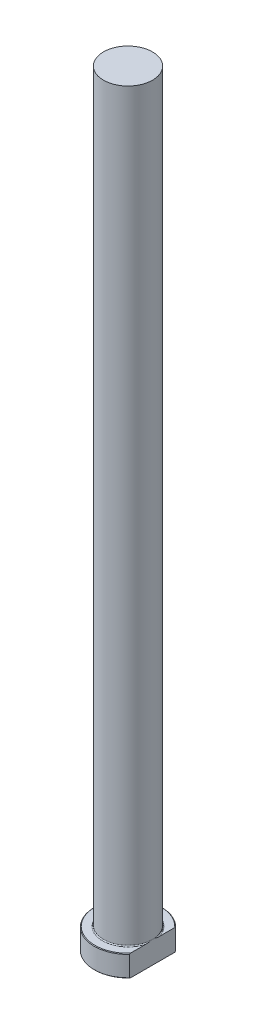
ISO-10303-21;
HEADER;
FILE_DESCRIPTION(('STEP AP214'),'2;1');
FILE_NAME('part.step','',(''),(''),'','','');
FILE_SCHEMA(('AUTOMOTIVE_DESIGN { 1 0 10303 214 1 1 1 1 }'));
ENDSEC;
DATA;
#1=APPLICATION_CONTEXT('core data for automotive mechanical design processes');
#2=APPLICATION_PROTOCOL_DEFINITION('international standard','automotive_design',2000,#1);
#3=PRODUCT_CONTEXT('',#1,'mechanical');
#4=PRODUCT('Part','Part','',(#3));
#5=PRODUCT_RELATED_PRODUCT_CATEGORY('part','',(#4));
#6=PRODUCT_DEFINITION_FORMATION('','',#4);
#7=PRODUCT_DEFINITION_CONTEXT('part definition',#1,'design');
#8=PRODUCT_DEFINITION('design','',#6,#7);
#9=PRODUCT_DEFINITION_SHAPE('','',#8);
#10=(LENGTH_UNIT() NAMED_UNIT(*) SI_UNIT(.MILLI.,.METRE.));
#11=(NAMED_UNIT(*) PLANE_ANGLE_UNIT() SI_UNIT($,.RADIAN.));
#12=(NAMED_UNIT(*) SI_UNIT($,.STERADIAN.) SOLID_ANGLE_UNIT());
#13=UNCERTAINTY_MEASURE_WITH_UNIT(LENGTH_MEASURE(1.E-05),#10,'distance_accuracy_value','');
#14=(GEOMETRIC_REPRESENTATION_CONTEXT(3) GLOBAL_UNCERTAINTY_ASSIGNED_CONTEXT((#13)) GLOBAL_UNIT_ASSIGNED_CONTEXT((#10,
#11,#12)) REPRESENTATION_CONTEXT('',''));
#15=CARTESIAN_POINT('',(0.,0.,0.));
#16=DIRECTION('',(0.,0.,1.));
#17=DIRECTION('',(1.,0.,0.));
#18=AXIS2_PLACEMENT_3D('',#15,#16,#17);
#19=CARTESIAN_POINT('',(0.,0.,0.));
#20=DIRECTION('',(0.,-1.,0.));
#21=DIRECTION('',(0.,0.,-1.));
#22=AXIS2_PLACEMENT_3D('',#19,#20,#21);
#23=PLANE('',#22);
#24=CARTESIAN_POINT('',(0.,0.,0.));
#25=DIRECTION('',(0.,-1.,0.));
#26=DIRECTION('',(0.,0.,-1.));
#27=AXIS2_PLACEMENT_3D('',#24,#25,#26);
#28=CIRCLE('',#27,10.7999999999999);
#29=CARTESIAN_POINT('',(7.99999999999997,0.,7.25534285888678));
#30=VERTEX_POINT('',#29);
#31=CARTESIAN_POINT('',(7.99999999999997,0.,-7.25534285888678));
#32=VERTEX_POINT('',#31);
#33=EDGE_CURVE('E98',#30,#32,#28,.T.);
#34=ORIENTED_EDGE('',*,*,#33,.T.);
#35=DIRECTION('',(0.,0.,1.));
#36=VECTOR('',#35,1.);
#37=CARTESIAN_POINT('',(7.99999999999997,0.,-7.54983443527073));
#38=LINE('',#37,#36);
#39=EDGE_CURVE('E83',#32,#30,#38,.T.);
#40=ORIENTED_EDGE('',*,*,#39,.T.);
#41=EDGE_LOOP('',(#34,#40));
#42=FACE_BOUND('',#41,.T.);
#43=ADVANCED_FACE('F32',(#42),#23,.T.);
#44=CARTESIAN_POINT('',(0.,259.958771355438,0.));
#45=DIRECTION('',(0.,1.,0.));
#46=DIRECTION('',(0.,0.,1.));
#47=AXIS2_PLACEMENT_3D('',#44,#45,#46);
#48=CYLINDRICAL_SURFACE('',#47,11.);
#49=CARTESIAN_POINT('',(0.,6.79999999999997,0.));
#50=DIRECTION('',(0.,1.,0.));
#51=DIRECTION('',(0.,0.,1.));
#52=AXIS2_PLACEMENT_3D('',#49,#50,#51);
#53=CIRCLE('',#52,11.);
#54=CARTESIAN_POINT('',(7.99999999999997,6.79999999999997,7.54983443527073));
#55=VERTEX_POINT('',#54);
#56=CARTESIAN_POINT('',(7.99999999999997,6.79999999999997,-7.54983443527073));
#57=VERTEX_POINT('',#56);
#58=EDGE_CURVE('E104',#55,#57,#53,.F.);
#59=ORIENTED_EDGE('',*,*,#58,.T.);
#60=DIRECTION('',(0.,-1.,0.));
#61=VECTOR('',#60,1.);
#62=CARTESIAN_POINT('',(7.99999999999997,250.,-7.54983443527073));
#63=LINE('',#62,#61);
#64=CARTESIAN_POINT('',(7.99999999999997,0.200000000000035,-7.54983443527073));
#65=VERTEX_POINT('',#64);
#66=EDGE_CURVE('E183',#57,#65,#63,.T.);
#67=ORIENTED_EDGE('',*,*,#66,.T.);
#68=CARTESIAN_POINT('',(0.,0.200000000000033,0.));
#69=DIRECTION('',(0.,-1.,0.));
#70=DIRECTION('',(0.,0.,-1.));
#71=AXIS2_PLACEMENT_3D('',#68,#69,#70);
#72=CIRCLE('',#71,11.);
#73=CARTESIAN_POINT('',(7.99999999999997,0.200000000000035,7.54983443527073));
#74=VERTEX_POINT('',#73);
#75=EDGE_CURVE('E100',#65,#74,#72,.F.);
#76=ORIENTED_EDGE('',*,*,#75,.T.);
#77=DIRECTION('',(0.,-1.,0.));
#78=VECTOR('',#77,1.);
#79=CARTESIAN_POINT('',(7.99999999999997,250.,7.54983443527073));
#80=LINE('',#79,#78);
#81=EDGE_CURVE('E93',#55,#74,#80,.T.);
#82=ORIENTED_EDGE('',*,*,#81,.F.);
#83=EDGE_LOOP('',(#59,#67,#76,#82));
#84=FACE_BOUND('',#83,.T.);
#85=ADVANCED_FACE('F158',(#84),#48,.T.);
#86=CARTESIAN_POINT('',(-11.,7.,0.));
#87=DIRECTION('',(0.,1.,0.));
#88=DIRECTION('',(0.,0.,1.));
#89=AXIS2_PLACEMENT_3D('',#86,#87,#88);
#90=PLANE('',#89);
#91=CARTESIAN_POINT('',(0.,7.,0.));
#92=DIRECTION('',(0.,1.,0.));
#93=DIRECTION('',(0.,0.,1.));
#94=AXIS2_PLACEMENT_3D('',#91,#92,#93);
#95=CIRCLE('',#94,10.8);
#96=CARTESIAN_POINT('',(7.99999999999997,7.,-7.25534285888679));
#97=VERTEX_POINT('',#96);
#98=CARTESIAN_POINT('',(7.99999999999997,7.,7.25534285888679));
#99=VERTEX_POINT('',#98);
#100=EDGE_CURVE('E178',#97,#99,#95,.T.);
#101=ORIENTED_EDGE('',*,*,#100,.T.);
#102=DIRECTION('',(0.,0.,-1.));
#103=VECTOR('',#102,1.);
#104=CARTESIAN_POINT('',(7.99999999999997,7.,0.));
#105=LINE('',#104,#103);
#106=CARTESIAN_POINT('',(7.99999999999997,6.99999999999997,2.21133443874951));
#107=VERTEX_POINT('',#106);
#108=EDGE_CURVE('E57',#99,#107,#105,.T.);
#109=ORIENTED_EDGE('',*,*,#108,.T.);
#110=CARTESIAN_POINT('',(0.,7.,0.));
#111=DIRECTION('',(0.,1.,0.));
#112=DIRECTION('',(0.,0.,1.));
#113=AXIS2_PLACEMENT_3D('',#110,#111,#112);
#114=CIRCLE('',#113,8.29999999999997);
#115=CARTESIAN_POINT('',(7.99999999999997,6.99999999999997,-2.21133443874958));
#116=VERTEX_POINT('',#115);
#117=EDGE_CURVE('E107',#107,#116,#114,.F.);
#118=ORIENTED_EDGE('',*,*,#117,.T.);
#119=EDGE_CURVE('E136',#116,#97,#105,.T.);
#120=ORIENTED_EDGE('',*,*,#119,.T.);
#121=EDGE_LOOP('',(#101,#109,#118,#120));
#122=FACE_BOUND('',#121,.T.);
#123=ADVANCED_FACE('F147',(#122),#90,.T.);
#124=CARTESIAN_POINT('',(0.,7.00000000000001,0.));
#125=DIRECTION('',(0.,-1.,0.));
#126=DIRECTION('',(0.,0.,-1.));
#127=AXIS2_PLACEMENT_3D('',#124,#125,#126);
#128=CONICAL_SURFACE('',#127,10.7999999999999,0.785398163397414);
#129=ORIENTED_EDGE('',*,*,#58,.F.);
#130=CARTESIAN_POINT('',(7.99999999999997,-0.636730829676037,16.6106304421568));
#131=CARTESIAN_POINT('',(7.99999999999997,-0.418611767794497,16.3685283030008));
#132=CARTESIAN_POINT('',(7.99999999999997,-0.200984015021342,16.1259843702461));
#133=CARTESIAN_POINT('',(7.99999999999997,0.233148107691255,15.6398927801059));
#134=CARTESIAN_POINT('',(7.99999999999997,0.449652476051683,15.3963451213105));
#135=CARTESIAN_POINT('',(7.99999999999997,1.09739989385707,14.6638687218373));
#136=CARTESIAN_POINT('',(7.99999999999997,1.52674426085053,14.1732538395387));
#137=CARTESIAN_POINT('',(7.99999999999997,2.16792810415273,13.4304656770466));
#138=CARTESIAN_POINT('',(7.99999999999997,2.38226067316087,13.180443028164));
#139=CARTESIAN_POINT('',(7.99999999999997,2.80892954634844,12.6787083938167));
#140=CARTESIAN_POINT('',(7.99999999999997,3.02126589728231,12.4269964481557));
#141=CARTESIAN_POINT('',(7.99999999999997,3.44357020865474,11.9216744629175));
#142=CARTESIAN_POINT('',(7.99999999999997,3.6535386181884,11.6680647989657));
#143=CARTESIAN_POINT('',(7.99999999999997,4.07074862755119,11.1585723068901));
#144=CARTESIAN_POINT('',(7.99999999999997,4.27798998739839,10.9026892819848));
#145=CARTESIAN_POINT('',(7.99999999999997,4.66965190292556,10.4127607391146));
#146=CARTESIAN_POINT('',(7.99999999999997,4.85436868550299,10.1789522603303));
#147=CARTESIAN_POINT('',(7.99999999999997,5.22063517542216,9.70886883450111));
#148=CARTESIAN_POINT('',(7.99999999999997,5.4021849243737,9.47259391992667));
#149=CARTESIAN_POINT('',(7.99999999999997,5.76149237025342,8.99721569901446));
#150=CARTESIAN_POINT('',(7.99999999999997,5.93925050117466,8.75811272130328));
#151=CARTESIAN_POINT('',(7.99999999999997,6.29022306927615,8.276601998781));
#152=CARTESIAN_POINT('',(7.99999999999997,6.46343768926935,8.03419438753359));
#153=CARTESIAN_POINT('',(7.99999999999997,6.80398487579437,7.54604999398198));
#154=CARTESIAN_POINT('',(7.99999999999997,6.97132935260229,7.3003215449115));
#155=CARTESIAN_POINT('',(7.99999999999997,7.29928849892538,6.80437777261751));
#156=CARTESIAN_POINT('',(7.99999999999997,7.45990280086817,6.55416220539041));
#157=CARTESIAN_POINT('',(7.99999999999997,7.77264940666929,6.04873149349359));
#158=CARTESIAN_POINT('',(7.99999999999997,7.92478824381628,5.79352041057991));
#159=CARTESIAN_POINT('',(7.99999999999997,8.21859570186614,5.27715744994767));
#160=CARTESIAN_POINT('',(7.99999999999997,8.36026610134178,5.01600659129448));
#161=CARTESIAN_POINT('',(7.99999999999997,8.62213596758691,4.50319242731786));
#162=CARTESIAN_POINT('',(7.99999999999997,8.74311989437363,4.25193242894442));
#163=CARTESIAN_POINT('',(7.99999999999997,8.97065709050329,3.74287674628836));
#164=CARTESIAN_POINT('',(7.99999999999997,9.07720941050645,3.48508063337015));
#165=CARTESIAN_POINT('',(7.99999999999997,9.27220860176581,2.96337495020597));
#166=CARTESIAN_POINT('',(7.99999999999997,9.36069936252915,2.69948197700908));
#167=CARTESIAN_POINT('',(7.99999999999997,9.51604316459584,2.16542713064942));
#168=CARTESIAN_POINT('',(7.99999999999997,9.58290677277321,1.89526838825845));
#169=CARTESIAN_POINT('',(7.99999999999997,9.68291221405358,1.39216000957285));
#170=CARTESIAN_POINT('',(7.99999999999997,9.71967474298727,1.15993430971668));
#171=CARTESIAN_POINT('',(7.99999999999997,9.77336730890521,0.69319665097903));
#172=CARTESIAN_POINT('',(7.99999999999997,9.7903003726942,0.458685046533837));
#173=CARTESIAN_POINT('',(7.99999999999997,9.8034285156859,-0.0106727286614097));
#174=CARTESIAN_POINT('',(7.99999999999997,9.79964609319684,-0.245518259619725));
#175=CARTESIAN_POINT('',(7.99999999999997,9.77160926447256,-0.713989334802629));
#176=CARTESIAN_POINT('',(7.99999999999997,9.74735189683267,-0.94761469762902));
#177=CARTESIAN_POINT('',(7.99999999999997,9.67070830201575,-1.47287443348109));
#178=CARTESIAN_POINT('',(7.99999999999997,9.61261890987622,-1.76367634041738));
#179=CARTESIAN_POINT('',(7.99999999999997,9.46982192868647,-2.33873282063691));
#180=CARTESIAN_POINT('',(7.99999999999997,9.38509750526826,-2.62298313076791));
#181=CARTESIAN_POINT('',(7.99999999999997,9.24134311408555,-3.04436856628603));
#182=CARTESIAN_POINT('',(7.99999999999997,9.19048552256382,-3.18437323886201));
#183=CARTESIAN_POINT('',(7.99999999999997,9.0838167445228,-3.4624156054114));
#184=CARTESIAN_POINT('',(7.99999999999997,9.0280078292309,-3.60045416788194));
#185=CARTESIAN_POINT('',(7.99999999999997,8.91195481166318,-3.87463242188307));
#186=CARTESIAN_POINT('',(7.99999999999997,8.85171106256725,-4.01077226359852));
#187=CARTESIAN_POINT('',(7.99999999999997,8.72725899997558,-4.28124317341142));
#188=CARTESIAN_POINT('',(7.99999999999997,8.66305017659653,-4.41557400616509));
#189=CARTESIAN_POINT('',(7.99999999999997,8.48984738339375,-4.76597692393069));
#190=CARTESIAN_POINT('',(7.99999999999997,8.37796178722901,-4.98062176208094));
#191=CARTESIAN_POINT('',(7.99999999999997,8.14649205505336,-5.40573762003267));
#192=CARTESIAN_POINT('',(7.99999999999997,8.02690659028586,-5.61620791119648));
#193=CARTESIAN_POINT('',(7.99999999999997,7.78128707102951,-6.03349586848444));
#194=CARTESIAN_POINT('',(7.99999999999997,7.65524949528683,-6.24031145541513));
#195=CARTESIAN_POINT('',(7.99999999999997,7.39783636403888,-6.65060320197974));
#196=CARTESIAN_POINT('',(7.99999999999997,7.26646042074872,-6.85407911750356));
#197=CARTESIAN_POINT('',(7.99999999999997,6.99890352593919,-7.25856399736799));
#198=CARTESIAN_POINT('',(7.99999999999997,6.86271149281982,-7.45956561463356));
#199=CARTESIAN_POINT('',(7.99999999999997,6.58651908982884,-7.85893907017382));
#200=CARTESIAN_POINT('',(7.99999999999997,6.4465185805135,-8.05731081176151));
#201=CARTESIAN_POINT('',(7.99999999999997,6.02178241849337,-8.6488124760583));
#202=CARTESIAN_POINT('',(7.99999999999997,5.73221467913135,-9.03847436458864));
#203=CARTESIAN_POINT('',(7.99999999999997,5.14234581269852,-9.8121850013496));
#204=CARTESIAN_POINT('',(7.99999999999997,4.84200393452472,-10.1962024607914));
#205=CARTESIAN_POINT('',(7.99999999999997,4.23404813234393,-10.9584616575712));
#206=CARTESIAN_POINT('',(7.99999999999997,3.92643376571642,-11.336703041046));
#207=CARTESIAN_POINT('',(7.99999999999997,3.30600745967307,-12.0880358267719));
#208=CARTESIAN_POINT('',(7.99999999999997,2.99320302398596,-12.4611334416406));
#209=CARTESIAN_POINT('',(7.99999999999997,2.36317801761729,-13.2035599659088));
#210=CARTESIAN_POINT('',(7.99999999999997,2.04595754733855,-13.5728889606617));
#211=CARTESIAN_POINT('',(7.99999999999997,1.33644011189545,-14.3909378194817));
#212=CARTESIAN_POINT('',(7.99999999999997,0.943258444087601,-14.8388897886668));
#213=CARTESIAN_POINT('',(7.99999999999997,0.35148359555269,-15.506812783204));
#214=CARTESIAN_POINT('',(7.99999999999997,0.154449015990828,-15.7281687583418));
#215=CARTESIAN_POINT('',(7.99999999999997,-0.240498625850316,-16.1700151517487));
#216=CARTESIAN_POINT('',(7.99999999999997,-0.438411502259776,-16.390505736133));
#217=CARTESIAN_POINT('',(7.99999999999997,-0.636730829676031,-16.6106304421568));
#218=B_SPLINE_CURVE_WITH_KNOTS('',3,(#130,#131,#132,#133,#134,#135,#136,#137,#138,#139,#140,
#141,#142,#143,#144,#145,#146,#147,#148,#149,#150,#151,#152,#153,#154,#155,#156,#157,#158,#159,
#160,#161,#162,#163,#164,#165,#166,#167,#168,#169,#170,#171,#172,#173,#174,#175,#176,#177,#178,
#179,#180,#181,#182,#183,#184,#185,#186,#187,#188,#189,#190,#191,#192,#193,#194,#195,#196,#197,
#198,#199,#200,#201,#202,#203,#204,#205,#206,#207,#208,#209,#210,#211,#212,#213,#214,#215,#216,
#217),.UNSPECIFIED.,.F.,.F.,(4,2,2,2,2,2,2,2,2,2,2,2,2,2,2,2,2,2,2,2,2,2,2,2,2,2,2,2,2,2,2,2,2,
2,2,2,2,2,2,2,2,2,2,4),(0.,0.977598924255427,1.95519922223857,3.91099512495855,4.89893858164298,
5.88685884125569,6.87458847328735,7.86240445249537,8.75629469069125,9.65017317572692,
10.5439487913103,11.4376883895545,12.3294952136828,13.2213506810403,14.1125088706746,
15.0035153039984,15.8397621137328,16.6760639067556,17.5103086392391,18.3441451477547,
19.0487229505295,19.7531931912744,20.4568984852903,21.1607055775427,22.0488428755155,
22.9375426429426,23.3843335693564,23.830920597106,24.2774720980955,24.72408114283,
25.4500411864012,26.1761268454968,26.902613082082,27.6291521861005,28.3574884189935,
29.0858513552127,30.5420520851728,32.0045059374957,33.4670490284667,34.9276355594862,
36.3881889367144,38.1762452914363,39.0652821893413,39.9541391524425),.UNSPECIFIED.);
#219=EDGE_CURVE('E135',#55,#99,#218,.T.);
#220=ORIENTED_EDGE('',*,*,#219,.T.);
#221=ORIENTED_EDGE('',*,*,#100,.F.);
#222=EDGE_CURVE('E127',#97,#57,#218,.T.);
#223=ORIENTED_EDGE('',*,*,#222,.T.);
#224=EDGE_LOOP('',(#129,#220,#221,#223));
#225=FACE_BOUND('',#224,.T.);
#226=ADVANCED_FACE('F143',(#225),#128,.T.);
#227=CARTESIAN_POINT('',(0.,0.200000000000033,0.));
#228=DIRECTION('',(0.,1.,0.));
#229=DIRECTION('',(0.,0.,1.));
#230=AXIS2_PLACEMENT_3D('',#227,#228,#229);
#231=CONICAL_SURFACE('',#230,11.,0.785398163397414);
#232=ORIENTED_EDGE('',*,*,#75,.F.);
#233=CARTESIAN_POINT('',(7.99999999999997,7.63673082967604,-16.6106304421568));
#234=CARTESIAN_POINT('',(7.99999999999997,7.4186117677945,-16.3685283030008));
#235=CARTESIAN_POINT('',(7.99999999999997,7.20098401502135,-16.1259843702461));
#236=CARTESIAN_POINT('',(7.99999999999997,6.76685189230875,-15.6398927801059));
#237=CARTESIAN_POINT('',(7.99999999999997,6.55034752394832,-15.3963451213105));
#238=CARTESIAN_POINT('',(7.99999999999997,5.90260010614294,-14.6638687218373));
#239=CARTESIAN_POINT('',(7.99999999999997,5.47325573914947,-14.1732538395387));
#240=CARTESIAN_POINT('',(7.99999999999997,4.83207189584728,-13.4304656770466));
#241=CARTESIAN_POINT('',(7.99999999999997,4.61773932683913,-13.180443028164));
#242=CARTESIAN_POINT('',(7.99999999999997,4.19107045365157,-12.6787083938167));
#243=CARTESIAN_POINT('',(7.99999999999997,3.9787341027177,-12.4269964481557));
#244=CARTESIAN_POINT('',(7.99999999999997,3.55642979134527,-11.9216744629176));
#245=CARTESIAN_POINT('',(7.99999999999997,3.34646138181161,-11.6680647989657));
#246=CARTESIAN_POINT('',(7.99999999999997,2.92925137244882,-11.1585723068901));
#247=CARTESIAN_POINT('',(7.99999999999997,2.72201001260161,-10.9026892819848));
#248=CARTESIAN_POINT('',(7.99999999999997,2.33034809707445,-10.4127607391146));
#249=CARTESIAN_POINT('',(7.99999999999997,2.14563131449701,-10.1789522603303));
#250=CARTESIAN_POINT('',(7.99999999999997,1.77936482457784,-9.70886883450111));
#251=CARTESIAN_POINT('',(7.99999999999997,1.59781507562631,-9.47259391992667));
#252=CARTESIAN_POINT('',(7.99999999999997,1.23850762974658,-8.99721569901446));
#253=CARTESIAN_POINT('',(7.99999999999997,1.06074949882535,-8.75811272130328));
#254=CARTESIAN_POINT('',(7.99999999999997,0.709776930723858,-8.276601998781));
#255=CARTESIAN_POINT('',(7.99999999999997,0.536562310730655,-8.03419438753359));
#256=CARTESIAN_POINT('',(7.99999999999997,0.196015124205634,-7.54604999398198));
#257=CARTESIAN_POINT('',(7.99999999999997,0.0286706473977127,-7.3003215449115));
#258=CARTESIAN_POINT('',(7.99999999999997,-0.299288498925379,-6.80437777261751));
#259=CARTESIAN_POINT('',(7.99999999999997,-0.459902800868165,-6.55416220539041));
#260=CARTESIAN_POINT('',(7.99999999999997,-0.772649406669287,-6.04873149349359));
#261=CARTESIAN_POINT('',(7.99999999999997,-0.924788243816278,-5.7935204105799));
#262=CARTESIAN_POINT('',(7.99999999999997,-1.21859570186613,-5.27715744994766));
#263=CARTESIAN_POINT('',(7.99999999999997,-1.36026610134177,-5.01600659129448));
#264=CARTESIAN_POINT('',(7.99999999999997,-1.62213596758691,-4.50319242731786));
#265=CARTESIAN_POINT('',(7.99999999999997,-1.74311989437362,-4.25193242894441));
#266=CARTESIAN_POINT('',(7.99999999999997,-1.97065709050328,-3.74287674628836));
#267=CARTESIAN_POINT('',(7.99999999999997,-2.07720941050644,-3.48508063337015));
#268=CARTESIAN_POINT('',(7.99999999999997,-2.27220860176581,-2.96337495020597));
#269=CARTESIAN_POINT('',(7.99999999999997,-2.36069936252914,-2.69948197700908));
#270=CARTESIAN_POINT('',(7.99999999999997,-2.51604316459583,-2.16542713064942));
#271=CARTESIAN_POINT('',(7.99999999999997,-2.58290677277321,-1.89526838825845));
#272=CARTESIAN_POINT('',(7.99999999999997,-2.68291221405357,-1.39216000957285));
#273=CARTESIAN_POINT('',(7.99999999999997,-2.71967474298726,-1.15993430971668));
#274=CARTESIAN_POINT('',(7.99999999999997,-2.77336730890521,-0.693196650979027));
#275=CARTESIAN_POINT('',(7.99999999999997,-2.7903003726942,-0.458685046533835));
#276=CARTESIAN_POINT('',(7.99999999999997,-2.80342851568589,0.0106727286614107));
#277=CARTESIAN_POINT('',(7.99999999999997,-2.79964609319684,0.245518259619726));
#278=CARTESIAN_POINT('',(7.99999999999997,-2.77160926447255,0.71398933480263));
#279=CARTESIAN_POINT('',(7.99999999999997,-2.74735189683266,0.94761469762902));
#280=CARTESIAN_POINT('',(7.99999999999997,-2.67070830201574,1.47287443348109));
#281=CARTESIAN_POINT('',(7.99999999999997,-2.61261890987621,1.76367634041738));
#282=CARTESIAN_POINT('',(7.99999999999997,-2.46982192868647,2.33873282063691));
#283=CARTESIAN_POINT('',(7.99999999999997,-2.38509750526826,2.62298313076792));
#284=CARTESIAN_POINT('',(7.99999999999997,-2.24134311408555,3.04436856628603));
#285=CARTESIAN_POINT('',(7.99999999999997,-2.19048552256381,3.184373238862));
#286=CARTESIAN_POINT('',(7.99999999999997,-2.08381674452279,3.46241560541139));
#287=CARTESIAN_POINT('',(7.99999999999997,-2.02800782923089,3.60045416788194));
#288=CARTESIAN_POINT('',(7.99999999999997,-1.91195481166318,3.87463242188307));
#289=CARTESIAN_POINT('',(7.99999999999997,-1.85171106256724,4.01077226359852));
#290=CARTESIAN_POINT('',(7.99999999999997,-1.72725899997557,4.28124317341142));
#291=CARTESIAN_POINT('',(7.99999999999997,-1.66305017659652,4.4155740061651));
#292=CARTESIAN_POINT('',(7.99999999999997,-1.48984738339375,4.76597692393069));
#293=CARTESIAN_POINT('',(7.99999999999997,-1.377961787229,4.98062176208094));
#294=CARTESIAN_POINT('',(7.99999999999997,-1.14649205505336,5.40573762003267));
#295=CARTESIAN_POINT('',(7.99999999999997,-1.02690659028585,5.61620791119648));
#296=CARTESIAN_POINT('',(7.99999999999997,-0.781287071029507,6.03349586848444));
#297=CARTESIAN_POINT('',(7.99999999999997,-0.655249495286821,6.24031145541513));
#298=CARTESIAN_POINT('',(7.99999999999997,-0.397836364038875,6.65060320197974));
#299=CARTESIAN_POINT('',(7.99999999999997,-0.266460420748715,6.85407911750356));
#300=CARTESIAN_POINT('',(7.99999999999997,0.00109647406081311,7.25856399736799));
#301=CARTESIAN_POINT('',(7.99999999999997,0.137288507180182,7.45956561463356));
#302=CARTESIAN_POINT('',(7.99999999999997,0.413480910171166,7.85893907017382));
#303=CARTESIAN_POINT('',(7.99999999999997,0.553481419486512,8.05731081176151));
#304=CARTESIAN_POINT('',(7.99999999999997,0.978217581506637,8.6488124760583));
#305=CARTESIAN_POINT('',(7.99999999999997,1.26778532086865,9.03847436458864));
#306=CARTESIAN_POINT('',(7.99999999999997,1.85765418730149,9.8121850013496));
#307=CARTESIAN_POINT('',(7.99999999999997,2.15799606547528,10.1962024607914));
#308=CARTESIAN_POINT('',(7.99999999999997,2.76595186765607,10.9584616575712));
#309=CARTESIAN_POINT('',(7.99999999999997,3.07356623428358,11.3367030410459));
#310=CARTESIAN_POINT('',(7.99999999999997,3.69399254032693,12.0880358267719));
#311=CARTESIAN_POINT('',(7.99999999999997,4.00679697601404,12.4611334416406));
#312=CARTESIAN_POINT('',(7.99999999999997,4.63682198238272,13.2035599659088));
#313=CARTESIAN_POINT('',(7.99999999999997,4.95404245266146,13.5728889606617));
#314=CARTESIAN_POINT('',(7.99999999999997,5.66355988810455,14.3909378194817));
#315=CARTESIAN_POINT('',(7.99999999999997,6.0567415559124,14.8388897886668));
#316=CARTESIAN_POINT('',(7.99999999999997,6.64851640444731,15.506812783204));
#317=CARTESIAN_POINT('',(7.99999999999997,6.84555098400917,15.7281687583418));
#318=CARTESIAN_POINT('',(7.99999999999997,7.24049862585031,16.1700151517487));
#319=CARTESIAN_POINT('',(7.99999999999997,7.43841150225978,16.390505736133));
#320=CARTESIAN_POINT('',(7.99999999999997,7.63673082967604,16.6106304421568));
#321=B_SPLINE_CURVE_WITH_KNOTS('',3,(#233,#234,#235,#236,#237,#238,#239,#240,#241,#242,#243,
#244,#245,#246,#247,#248,#249,#250,#251,#252,#253,#254,#255,#256,#257,#258,#259,#260,#261,#262,
#263,#264,#265,#266,#267,#268,#269,#270,#271,#272,#273,#274,#275,#276,#277,#278,#279,#280,#281,
#282,#283,#284,#285,#286,#287,#288,#289,#290,#291,#292,#293,#294,#295,#296,#297,#298,#299,#300,
#301,#302,#303,#304,#305,#306,#307,#308,#309,#310,#311,#312,#313,#314,#315,#316,#317,#318,#319,
#320),.UNSPECIFIED.,.F.,.F.,(4,2,2,2,2,2,2,2,2,2,2,2,2,2,2,2,2,2,2,2,2,2,2,2,2,2,2,2,2,2,2,2,2,
2,2,2,2,2,2,2,2,2,2,4),(0.,0.977598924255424,1.95519922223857,3.91099512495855,4.89893858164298,
5.88685884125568,6.87458847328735,7.86240445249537,8.75629469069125,9.65017317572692,
10.5439487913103,11.4376883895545,12.3294952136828,13.2213506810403,14.1125088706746,
15.0035153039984,15.8397621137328,16.6760639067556,17.5103086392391,18.3441451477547,
19.0487229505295,19.7531931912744,20.4568984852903,21.1607055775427,22.0488428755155,
22.9375426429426,23.3843335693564,23.830920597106,24.2774720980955,24.72408114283,
25.4500411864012,26.1761268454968,26.902613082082,27.6291521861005,28.3574884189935,
29.0858513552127,30.5420520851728,32.0045059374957,33.4670490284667,34.9276355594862,
36.3881889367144,38.1762452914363,39.0652821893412,39.9541391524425),.UNSPECIFIED.);
#322=EDGE_CURVE('E86',#65,#32,#321,.T.);
#323=ORIENTED_EDGE('',*,*,#322,.T.);
#324=ORIENTED_EDGE('',*,*,#33,.F.);
#325=EDGE_CURVE('E89',#30,#74,#321,.T.);
#326=ORIENTED_EDGE('',*,*,#325,.T.);
#327=EDGE_LOOP('',(#232,#323,#324,#326));
#328=FACE_BOUND('',#327,.T.);
#329=ADVANCED_FACE('F97',(#328),#231,.T.);
#330=CARTESIAN_POINT('',(0.,7.29999999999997,0.));
#331=DIRECTION('',(0.,1.,0.));
#332=DIRECTION('',(0.,0.,1.));
#333=AXIS2_PLACEMENT_3D('',#330,#331,#332);
#334=TOROIDAL_SURFACE('',#333,8.29999999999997,0.3);
#335=CARTESIAN_POINT('',(7.99999999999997,7.29999999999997,0.));
#336=CARTESIAN_POINT('',(7.99999999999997,7.30000062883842,1.41343368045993E-10));
#337=CARTESIAN_POINT('',(7.99999999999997,7.30000125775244,-3.45355322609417E-07));
#338=CARTESIAN_POINT('',(7.99999999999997,7.30000241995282,-1.23398463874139E-06));
#339=CARTESIAN_POINT('',(7.99999999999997,7.30000291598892,-1.80141989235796E-06));
#340=CARTESIAN_POINT('',(7.99999999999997,7.30000399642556,-3.18390842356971E-06));
#341=CARTESIAN_POINT('',(7.99999999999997,7.30000456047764,-4.02115832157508E-06));
#342=CARTESIAN_POINT('',(7.99999999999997,7.30000552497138,-5.71072460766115E-06));
#343=CARTESIAN_POINT('',(7.99999999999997,7.30000593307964,-6.55926444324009E-06));
#344=CARTESIAN_POINT('',(7.99999999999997,7.30000755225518,-1.000964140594E-05));
#345=CARTESIAN_POINT('',(7.99999999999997,7.30000869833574,-1.26477244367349E-05));
#346=CARTESIAN_POINT('',(7.99999999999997,7.30001047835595,-1.77422280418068E-05));
#347=CARTESIAN_POINT('',(7.99999999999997,7.30001115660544,-2.01836505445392E-05));
#348=CARTESIAN_POINT('',(7.99999999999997,7.30001417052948,-3.09435594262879E-05));
#349=CARTESIAN_POINT('',(7.99999999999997,7.30001656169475,-3.92473415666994E-05));
#350=CARTESIAN_POINT('',(7.99999999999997,7.30001991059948,-5.46311733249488E-05));
#351=CARTESIAN_POINT('',(7.99999999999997,7.30002104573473,-6.16717033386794E-05));
#352=CARTESIAN_POINT('',(7.99999999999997,7.30002955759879,-0.000115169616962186));
#353=CARTESIAN_POINT('',(7.99999999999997,7.30003630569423,-0.000161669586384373));
#354=CARTESIAN_POINT('',(7.99999999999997,7.30006581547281,-0.00034712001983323));
#355=CARTESIAN_POINT('',(7.99999999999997,7.30009364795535,-0.000485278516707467));
#356=CARTESIAN_POINT('',(7.99999999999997,7.30020325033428,-0.00103711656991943));
#357=CARTESIAN_POINT('',(7.99999999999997,7.30028197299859,-0.00145117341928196));
#358=CARTESIAN_POINT('',(7.99999999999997,7.30059973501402,-0.00311182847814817));
#359=CARTESIAN_POINT('',(7.99999999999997,7.30084275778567,-0.00435790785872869));
#360=CARTESIAN_POINT('',(7.99999999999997,7.30186073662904,-0.00958966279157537));
#361=CARTESIAN_POINT('',(7.99999999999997,7.30263061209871,-0.0135760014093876));
#362=CARTESIAN_POINT('',(7.99999999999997,7.30870312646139,-0.0450030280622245));
#363=CARTESIAN_POINT('',(7.99999999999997,7.31402334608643,-0.0724414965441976));
#364=CARTESIAN_POINT('',(7.99999999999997,7.32442239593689,-0.126197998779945));
#365=CARTESIAN_POINT('',(7.99999999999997,7.32950218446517,-0.152515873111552));
#366=CARTESIAN_POINT('',(7.99999999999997,7.34609783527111,-0.23868034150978));
#367=CARTESIAN_POINT('',(7.99999999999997,7.35757011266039,-0.29853557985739));
#368=CARTESIAN_POINT('',(7.99999999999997,7.37688511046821,-0.400403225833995));
#369=CARTESIAN_POINT('',(7.99999999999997,7.38478827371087,-0.442404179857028));
#370=CARTESIAN_POINT('',(7.99999999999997,7.40022249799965,-0.525284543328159));
#371=CARTESIAN_POINT('',(7.99999999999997,7.40775782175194,-0.566163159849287));
#372=CARTESIAN_POINT('',(7.99999999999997,7.4322438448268,-0.700743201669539));
#373=CARTESIAN_POINT('',(7.99999999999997,7.44879297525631,-0.794518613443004));
#374=CARTESIAN_POINT('',(7.99999999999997,7.48053424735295,-0.983225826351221));
#375=CARTESIAN_POINT('',(7.99999999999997,7.49571186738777,-1.07816009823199));
#376=CARTESIAN_POINT('',(7.99999999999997,7.52532008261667,-1.27781321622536));
#377=CARTESIAN_POINT('',(7.99999999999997,7.53952614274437,-1.38256589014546));
#378=CARTESIAN_POINT('',(7.99999999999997,7.564310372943,-1.59223320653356));
#379=CARTESIAN_POINT('',(7.99999999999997,7.57489817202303,-1.6971466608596));
#380=CARTESIAN_POINT('',(7.99999999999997,7.58780012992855,-1.86417161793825));
#381=CARTESIAN_POINT('',(7.99999999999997,7.59172630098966,-1.92615747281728));
#382=CARTESIAN_POINT('',(7.99999999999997,7.59748111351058,-2.05022364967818));
#383=CARTESIAN_POINT('',(7.99999999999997,7.59931001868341,-2.11230395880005));
#384=CARTESIAN_POINT('',(7.99999999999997,7.60036180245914,-2.23528941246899));
#385=CARTESIAN_POINT('',(7.99999999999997,7.59963462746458,-2.29619395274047));
#386=CARTESIAN_POINT('',(7.99999999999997,7.59500883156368,-2.41785147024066));
#387=CARTESIAN_POINT('',(7.99999999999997,7.59111224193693,-2.47860451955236));
#388=CARTESIAN_POINT('',(7.99999999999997,7.57906933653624,-2.60042626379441));
#389=CARTESIAN_POINT('',(7.99999999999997,7.570876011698,-2.66149089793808));
#390=CARTESIAN_POINT('',(7.99999999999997,7.55390997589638,-2.7523359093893));
#391=CARTESIAN_POINT('',(7.99999999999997,7.54745990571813,-2.78254437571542));
#392=CARTESIAN_POINT('',(7.99999999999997,7.5325641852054,-2.84244543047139));
#393=CARTESIAN_POINT('',(7.99999999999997,7.52412026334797,-2.87213844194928));
#394=CARTESIAN_POINT('',(7.99999999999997,7.50454333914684,-2.93081083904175));
#395=CARTESIAN_POINT('',(7.99999999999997,7.4933995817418,-2.95978684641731));
#396=CARTESIAN_POINT('',(7.99999999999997,7.47379430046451,-3.00191342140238));
#397=CARTESIAN_POINT('',(7.99999999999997,7.46677809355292,-3.01573193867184));
#398=CARTESIAN_POINT('',(7.99999999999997,7.45153430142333,-3.04267574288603));
#399=CARTESIAN_POINT('',(7.99999999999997,7.44330842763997,-3.05580197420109));
#400=CARTESIAN_POINT('',(7.99999999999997,7.42520334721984,-3.0811225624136));
#401=CARTESIAN_POINT('',(7.99999999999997,7.41530529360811,-3.09330368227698));
#402=CARTESIAN_POINT('',(7.99999999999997,7.39348961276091,-3.11567039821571));
#403=CARTESIAN_POINT('',(7.99999999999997,7.38158911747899,-3.12587146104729));
#404=CARTESIAN_POINT('',(7.99999999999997,7.3626809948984,-3.13802739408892));
#405=CARTESIAN_POINT('',(7.99999999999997,7.35660667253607,-3.14142291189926));
#406=CARTESIAN_POINT('',(7.99999999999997,7.34401523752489,-3.14727797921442));
#407=CARTESIAN_POINT('',(7.99999999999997,7.33749832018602,-3.14973793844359));
#408=CARTESIAN_POINT('',(7.99999999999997,7.32406766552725,-3.15352036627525));
#409=CARTESIAN_POINT('',(7.99999999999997,7.31715078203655,-3.15483196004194));
#410=CARTESIAN_POINT('',(7.99999999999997,7.30319454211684,-3.15612126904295));
#411=CARTESIAN_POINT('',(7.99999999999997,7.29615528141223,-3.15609998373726));
#412=CARTESIAN_POINT('',(7.99999999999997,7.28287791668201,-3.15479583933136));
#413=CARTESIAN_POINT('',(7.99999999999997,7.27662738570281,-3.15363338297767));
#414=CARTESIAN_POINT('',(7.99999999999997,7.26438977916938,-3.15033645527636));
#415=CARTESIAN_POINT('',(7.99999999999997,7.25840290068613,-3.14820126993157));
#416=CARTESIAN_POINT('',(7.99999999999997,7.24428488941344,-3.14202752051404));
#417=CARTESIAN_POINT('',(7.99999999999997,7.2363403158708,-3.13756526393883));
#418=CARTESIAN_POINT('',(7.99999999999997,7.22124755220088,-3.1274544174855));
#419=CARTESIAN_POINT('',(7.99999999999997,7.21410153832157,-3.12180270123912));
#420=CARTESIAN_POINT('',(7.99999999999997,7.19559955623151,-3.10524942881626));
#421=CARTESIAN_POINT('',(7.99999999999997,7.18498382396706,-3.09352989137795));
#422=CARTESIAN_POINT('',(7.99999999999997,7.16550497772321,-3.068745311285));
#423=CARTESIAN_POINT('',(7.99999999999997,7.15664572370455,-3.05567739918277));
#424=CARTESIAN_POINT('',(7.99999999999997,7.13735489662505,-3.02391619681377));
#425=CARTESIAN_POINT('',(7.99999999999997,7.12749252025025,-3.00488123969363));
#426=CARTESIAN_POINT('',(7.99999999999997,7.10958189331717,-2.96596235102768));
#427=CARTESIAN_POINT('',(7.99999999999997,7.10153733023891,-2.9460767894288));
#428=CARTESIAN_POINT('',(7.99999999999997,7.08679055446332,-2.90559744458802));
#429=CARTESIAN_POINT('',(7.99999999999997,7.08010240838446,-2.88499860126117));
#430=CARTESIAN_POINT('',(7.99999999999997,7.06789000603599,-2.84348873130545));
#431=CARTESIAN_POINT('',(7.99999999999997,7.06236453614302,-2.8225780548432));
#432=CARTESIAN_POINT('',(7.99999999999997,7.04913807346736,-2.76752236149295));
#433=CARTESIAN_POINT('',(7.99999999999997,7.04220598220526,-2.73319311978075));
#434=CARTESIAN_POINT('',(7.99999999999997,7.0302605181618,-2.66419726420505));
#435=CARTESIAN_POINT('',(7.99999999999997,7.02524820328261,-2.62953047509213));
#436=CARTESIAN_POINT('',(7.99999999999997,7.0124950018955,-2.52504816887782));
#437=CARTESIAN_POINT('',(7.99999999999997,7.00708017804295,-2.45494936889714));
#438=CARTESIAN_POINT('',(7.99999999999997,7.000733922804,-2.31725135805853));
#439=CARTESIAN_POINT('',(7.99999999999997,6.99964073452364,-2.24965783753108));
#440=CARTESIAN_POINT('',(7.99999999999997,7.00055672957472,-2.11488194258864));
#441=CARTESIAN_POINT('',(7.99999999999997,7.00254831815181,-2.04769941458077));
#442=CARTESIAN_POINT('',(7.99999999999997,7.00911662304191,-1.91019632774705));
#443=CARTESIAN_POINT('',(7.99999999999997,7.01381425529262,-1.83988191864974));
#444=CARTESIAN_POINT('',(7.99999999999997,7.02534418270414,-1.69947139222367));
#445=CARTESIAN_POINT('',(7.99999999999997,7.0321753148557,-1.62937517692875));
#446=CARTESIAN_POINT('',(7.99999999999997,7.04774659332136,-1.48770318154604));
#447=CARTESIAN_POINT('',(7.99999999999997,7.05652844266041,-1.41613205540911));
#448=CARTESIAN_POINT('',(7.99999999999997,7.0755719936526,-1.2729917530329));
#449=CARTESIAN_POINT('',(7.99999999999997,7.08583764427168,-1.20142310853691));
#450=CARTESIAN_POINT('',(7.99999999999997,7.11167035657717,-1.03117663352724));
#451=CARTESIAN_POINT('',(7.99999999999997,7.12776522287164,-0.932579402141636));
#452=CARTESIAN_POINT('',(7.99999999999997,7.16130143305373,-0.736797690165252));
#453=CARTESIAN_POINT('',(7.99999999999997,7.1787249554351,-0.639610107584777));
#454=CARTESIAN_POINT('',(7.99999999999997,7.21241690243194,-0.456833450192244));
#455=CARTESIAN_POINT('',(7.99999999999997,7.22858010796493,-0.37122483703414));
#456=CARTESIAN_POINT('',(7.99999999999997,7.25353789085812,-0.240583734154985));
#457=CARTESIAN_POINT('',(7.99999999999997,7.26219901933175,-0.195525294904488));
#458=CARTESIAN_POINT('',(7.99999999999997,7.27945035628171,-0.106166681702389));
#459=CARTESIAN_POINT('',(7.99999999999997,7.28803936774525,-0.0618662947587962));
#460=CARTESIAN_POINT('',(7.99999999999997,7.29737150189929,-0.0135646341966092));
#461=CARTESIAN_POINT('',(7.99999999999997,7.29814363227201,-0.0095669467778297));
#462=CARTESIAN_POINT('',(7.99999999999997,7.29916212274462,-0.0043326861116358));
#463=CARTESIAN_POINT('',(7.99999999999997,7.29940341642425,-0.003095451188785));
#464=CARTESIAN_POINT('',(7.99999999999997,7.29971907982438,-0.00144576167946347));
#465=CARTESIAN_POINT('',(7.99999999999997,7.29979739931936,-0.00103382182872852));
#466=CARTESIAN_POINT('',(7.99999999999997,7.29990652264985,-0.000484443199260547));
#467=CARTESIAN_POINT('',(7.99999999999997,7.29993429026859,-0.000346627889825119));
#468=CARTESIAN_POINT('',(7.99999999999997,7.2999637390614,-0.000161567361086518));
#469=CARTESIAN_POINT('',(7.99999999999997,7.29997047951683,-0.000115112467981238));
#470=CARTESIAN_POINT('',(7.99999999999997,7.29997897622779,-6.16610384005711E-05));
#471=CARTESIAN_POINT('',(7.99999999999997,7.29998010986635,-5.46227082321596E-05));
#472=CARTESIAN_POINT('',(7.99999999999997,7.299983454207,-3.92436766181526E-05));
#473=CARTESIAN_POINT('',(7.99999999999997,7.2999858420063,-3.09423877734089E-05));
#474=CARTESIAN_POINT('',(7.99999999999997,7.29998885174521,-2.01851368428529E-05));
#475=CARTESIAN_POINT('',(7.99999999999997,7.29998952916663,-1.7743877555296E-05));
#476=CARTESIAN_POINT('',(7.99999999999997,7.29999130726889,-1.26495938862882E-05));
#477=CARTESIAN_POINT('',(7.99999999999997,7.29999245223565,-1.00115437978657E-05));
#478=CARTESIAN_POINT('',(7.99999999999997,7.29999406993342,-6.56108535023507E-06));
#479=CARTESIAN_POINT('',(7.99999999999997,7.29999447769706,-5.71247448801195E-06));
#480=CARTESIAN_POINT('',(7.99999999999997,7.29999544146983,-4.02270412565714E-06));
#481=CARTESIAN_POINT('',(7.99999999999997,7.2999960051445,-3.18531707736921E-06));
#482=CARTESIAN_POINT('',(7.99999999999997,7.29999708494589,-1.80252014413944E-06));
#483=CARTESIAN_POINT('',(7.99999999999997,7.29999758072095,-1.23492752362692E-06));
#484=CARTESIAN_POINT('',(7.99999999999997,7.29999874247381,-3.45879353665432E-07));
#485=CARTESIAN_POINT('',(7.99999999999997,7.29999937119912,-1.41334918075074E-10));
#486=CARTESIAN_POINT('',(7.99999999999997,7.29999999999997,0.));
#487=B_SPLINE_CURVE_WITH_KNOTS('',3,(#335,#336,#337,#338,#339,#340,#341,#342,#343,#344,#345,
#346,#347,#348,#349,#350,#351,#352,#353,#354,#355,#356,#357,#358,#359,#360,#361,#362,#363,#364,
#365,#366,#367,#368,#369,#370,#371,#372,#373,#374,#375,#376,#377,#378,#379,#380,#381,#382,#383,
#384,#385,#386,#387,#388,#389,#390,#391,#392,#393,#394,#395,#396,#397,#398,#399,#400,#401,#402,
#403,#404,#405,#406,#407,#408,#409,#410,#411,#412,#413,#414,#415,#416,#417,#418,#419,#420,#421,
#422,#423,#424,#425,#426,#427,#428,#429,#430,#431,#432,#433,#434,#435,#436,#437,#438,#439,#440,
#441,#442,#443,#444,#445,#446,#447,#448,#449,#450,#451,#452,#453,#454,#455,#456,#457,#458,#459,
#460,#461,#462,#463,#464,#465,#466,#467,#468,#469,#470,#471,#472,#473,#474,#475,#476,#477,#478,
#479,#480,#481,#482,#483,#484,#485,#486),.UNSPECIFIED.,.T.,.F.,(4,2,2,2,2,2,2,2,2,2,2,2,2,2,2,2,
2,2,2,2,2,2,2,2,2,2,2,2,2,2,2,2,2,2,2,2,2,2,2,2,2,2,2,2,2,2,2,2,2,2,2,2,2,2,2,2,2,2,2,2,2,2,2,2,
2,2,2,2,2,2,2,2,2,2,2,4),(0.,1.9430465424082E-06,4.23378863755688E-06,7.23541659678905E-06,
1.00606572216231E-05,1.86645549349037E-05,2.62590397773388E-05,5.21541728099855E-05,
7.352737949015E-05,0.000214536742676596,0.000637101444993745,0.00190178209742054,
0.00571013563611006,0.0178905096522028,0.101737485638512,0.182148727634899,0.364982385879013,
0.493196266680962,0.617898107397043,0.903563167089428,1.19196538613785,1.50905932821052,
1.82530271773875,2.01160528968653,2.19788443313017,2.38054404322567,2.56308667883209,
2.74766944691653,2.84028504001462,2.93282063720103,3.02573110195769,3.07218090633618,
3.11856561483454,3.1655130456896,3.21207753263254,3.23289308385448,3.25369950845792,
3.27470089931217,3.29568654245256,3.31467256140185,3.33367253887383,3.36085270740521,
3.38810522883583,3.43527567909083,3.48254866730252,3.54671214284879,3.61100462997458,
3.67593313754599,3.74079353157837,3.8457803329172,3.95082490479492,4.16152093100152,
4.36425153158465,4.56583006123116,4.77720385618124,4.98846262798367,5.20476776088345,
5.42165954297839,5.72134671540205,6.01755113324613,6.27891230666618,6.41656286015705,
6.55193629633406,6.56415137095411,6.56793269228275,6.5691909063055,6.56961242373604,
6.56975329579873,6.56977466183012,6.5698005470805,6.56980814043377,6.56981674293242,
6.56981956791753,6.56982256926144,6.56982485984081,6.56982680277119),.UNSPECIFIED.);
#488=CARTESIAN_POINT('',(7.99999999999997,7.29999999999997,0.));
#489=VERTEX_POINT('',#488);
#490=EDGE_CURVE('E11',#116,#489,#487,.T.);
#491=ORIENTED_EDGE('',*,*,#490,.F.);
#492=ORIENTED_EDGE('',*,*,#117,.F.);
#493=CARTESIAN_POINT('',(7.99999999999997,7.29999999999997,0.));
#494=CARTESIAN_POINT('',(7.99999999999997,7.29999937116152,-1.41343611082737E-10));
#495=CARTESIAN_POINT('',(7.99999999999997,7.29999874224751,3.45355322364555E-07));
#496=CARTESIAN_POINT('',(7.99999999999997,7.29999758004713,1.23398463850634E-06));
#497=CARTESIAN_POINT('',(7.99999999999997,7.29999708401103,1.80141989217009E-06));
#498=CARTESIAN_POINT('',(7.99999999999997,7.29999600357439,3.18390842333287E-06));
#499=CARTESIAN_POINT('',(7.99999999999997,7.29999543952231,4.0211583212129E-06));
#500=CARTESIAN_POINT('',(7.99999999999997,7.29999447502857,5.71072460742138E-06));
#501=CARTESIAN_POINT('',(7.99999999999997,7.2999940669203,6.55926444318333E-06));
#502=CARTESIAN_POINT('',(7.99999999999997,7.29999244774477,1.00096414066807E-05));
#503=CARTESIAN_POINT('',(7.99999999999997,7.2999913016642,1.26477244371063E-05));
#504=CARTESIAN_POINT('',(7.99999999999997,7.29998952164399,1.77422280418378E-05));
#505=CARTESIAN_POINT('',(7.99999999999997,7.2999888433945,2.01836505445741E-05));
#506=CARTESIAN_POINT('',(7.99999999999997,7.29998582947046,3.09435594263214E-05));
#507=CARTESIAN_POINT('',(7.99999999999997,7.29998343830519,3.92473415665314E-05));
#508=CARTESIAN_POINT('',(7.99999999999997,7.29998008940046,5.46311733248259E-05));
#509=CARTESIAN_POINT('',(7.99999999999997,7.29997895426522,6.16717033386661E-05));
#510=CARTESIAN_POINT('',(7.99999999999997,7.29997044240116,0.000115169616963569));
#511=CARTESIAN_POINT('',(7.99999999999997,7.29996369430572,0.000161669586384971));
#512=CARTESIAN_POINT('',(7.99999999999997,7.29993418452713,0.000347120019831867));
#513=CARTESIAN_POINT('',(7.99999999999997,7.2999063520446,0.000485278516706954));
#514=CARTESIAN_POINT('',(7.99999999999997,7.29979674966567,0.00103711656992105));
#515=CARTESIAN_POINT('',(7.99999999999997,7.29971802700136,0.00145117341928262));
#516=CARTESIAN_POINT('',(7.99999999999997,7.29940026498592,0.00311182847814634));
#517=CARTESIAN_POINT('',(7.99999999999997,7.29915724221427,0.00435790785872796));
#518=CARTESIAN_POINT('',(7.99999999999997,7.29813926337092,0.00958966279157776));
#519=CARTESIAN_POINT('',(7.99999999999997,7.29736938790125,0.0135760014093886));
#520=CARTESIAN_POINT('',(7.99999999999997,7.29129687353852,0.0450030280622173));
#521=CARTESIAN_POINT('',(7.99999999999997,7.28597665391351,0.0724414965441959));
#522=CARTESIAN_POINT('',(7.99999999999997,7.27557760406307,0.126197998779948));
#523=CARTESIAN_POINT('',(7.99999999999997,7.27049781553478,0.152515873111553));
#524=CARTESIAN_POINT('',(7.99999999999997,7.25390216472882,0.238680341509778));
#525=CARTESIAN_POINT('',(7.99999999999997,7.24242988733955,0.29853557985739));
#526=CARTESIAN_POINT('',(7.99999999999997,7.22311488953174,0.400403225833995));
#527=CARTESIAN_POINT('',(7.99999999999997,7.21521172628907,0.442404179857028));
#528=CARTESIAN_POINT('',(7.99999999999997,7.19977750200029,0.525284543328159));
#529=CARTESIAN_POINT('',(7.99999999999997,7.192242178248,0.566163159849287));
#530=CARTESIAN_POINT('',(7.99999999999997,7.16775615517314,0.700743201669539));
#531=CARTESIAN_POINT('',(7.99999999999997,7.15120702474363,0.794518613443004));
#532=CARTESIAN_POINT('',(7.99999999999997,7.119465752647,0.983225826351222));
#533=CARTESIAN_POINT('',(7.99999999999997,7.10428813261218,1.07816009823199));
#534=CARTESIAN_POINT('',(7.99999999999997,7.07467991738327,1.27781321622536));
#535=CARTESIAN_POINT('',(7.99999999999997,7.06047385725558,1.38256589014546));
#536=CARTESIAN_POINT('',(7.99999999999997,7.03568962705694,1.59223320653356));
#537=CARTESIAN_POINT('',(7.99999999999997,7.02510182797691,1.6971466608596));
#538=CARTESIAN_POINT('',(7.99999999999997,7.0121998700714,1.86417161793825));
#539=CARTESIAN_POINT('',(7.99999999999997,7.00827369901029,1.92615747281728));
#540=CARTESIAN_POINT('',(7.99999999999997,7.00251888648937,2.05022364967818));
#541=CARTESIAN_POINT('',(7.99999999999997,7.00068998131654,2.11230395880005));
#542=CARTESIAN_POINT('',(7.99999999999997,6.99963819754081,2.23528941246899));
#543=CARTESIAN_POINT('',(7.99999999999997,7.00036537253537,2.29619395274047));
#544=CARTESIAN_POINT('',(7.99999999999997,7.00499116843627,2.41785147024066));
#545=CARTESIAN_POINT('',(7.99999999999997,7.00888775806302,2.47860451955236));
#546=CARTESIAN_POINT('',(7.99999999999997,7.0209306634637,2.60042626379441));
#547=CARTESIAN_POINT('',(7.99999999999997,7.02912398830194,2.66149089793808));
#548=CARTESIAN_POINT('',(7.99999999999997,7.04609002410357,2.7523359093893));
#549=CARTESIAN_POINT('',(7.99999999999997,7.05254009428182,2.78254437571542));
#550=CARTESIAN_POINT('',(7.99999999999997,7.06743581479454,2.84244543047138));
#551=CARTESIAN_POINT('',(7.99999999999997,7.07587973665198,2.87213844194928));
#552=CARTESIAN_POINT('',(7.99999999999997,7.09545666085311,2.93081083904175));
#553=CARTESIAN_POINT('',(7.99999999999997,7.10660041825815,2.95978684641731));
#554=CARTESIAN_POINT('',(7.99999999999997,7.12620569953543,3.00191342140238));
#555=CARTESIAN_POINT('',(7.99999999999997,7.13322190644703,3.01573193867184));
#556=CARTESIAN_POINT('',(7.99999999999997,7.14846569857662,3.04267574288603));
#557=CARTESIAN_POINT('',(7.99999999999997,7.15669157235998,3.05580197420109));
#558=CARTESIAN_POINT('',(7.99999999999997,7.17479665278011,3.0811225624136));
#559=CARTESIAN_POINT('',(7.99999999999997,7.18469470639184,3.09330368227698));
#560=CARTESIAN_POINT('',(7.99999999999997,7.20651038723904,3.11567039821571));
#561=CARTESIAN_POINT('',(7.99999999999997,7.21841088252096,3.12587146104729));
#562=CARTESIAN_POINT('',(7.99999999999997,7.23731900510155,3.13802739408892));
#563=CARTESIAN_POINT('',(7.99999999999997,7.24339332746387,3.14142291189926));
#564=CARTESIAN_POINT('',(7.99999999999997,7.25598476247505,3.14727797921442));
#565=CARTESIAN_POINT('',(7.99999999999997,7.26250167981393,3.14973793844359));
#566=CARTESIAN_POINT('',(7.99999999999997,7.2759323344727,3.15352036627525));
#567=CARTESIAN_POINT('',(7.99999999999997,7.2828492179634,3.15483196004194));
#568=CARTESIAN_POINT('',(7.99999999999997,7.2968054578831,3.15612126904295));
#569=CARTESIAN_POINT('',(7.99999999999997,7.30384471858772,3.15609998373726));
#570=CARTESIAN_POINT('',(7.99999999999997,7.31712208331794,3.15479583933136));
#571=CARTESIAN_POINT('',(7.99999999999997,7.32337261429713,3.15363338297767));
#572=CARTESIAN_POINT('',(7.99999999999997,7.33561022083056,3.15033645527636));
#573=CARTESIAN_POINT('',(7.99999999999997,7.34159709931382,3.14820126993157));
#574=CARTESIAN_POINT('',(7.99999999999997,7.3557151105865,3.14202752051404));
#575=CARTESIAN_POINT('',(7.99999999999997,7.36365968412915,3.13756526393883));
#576=CARTESIAN_POINT('',(7.99999999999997,7.37875244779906,3.1274544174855));
#577=CARTESIAN_POINT('',(7.99999999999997,7.38589846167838,3.12180270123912));
#578=CARTESIAN_POINT('',(7.99999999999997,7.40440044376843,3.10524942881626));
#579=CARTESIAN_POINT('',(7.99999999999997,7.41501617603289,3.09352989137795));
#580=CARTESIAN_POINT('',(7.99999999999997,7.43449502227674,3.068745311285));
#581=CARTESIAN_POINT('',(7.99999999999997,7.4433542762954,3.05567739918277));
#582=CARTESIAN_POINT('',(7.99999999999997,7.4626451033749,3.02391619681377));
#583=CARTESIAN_POINT('',(7.99999999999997,7.47250747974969,3.00488123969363));
#584=CARTESIAN_POINT('',(7.99999999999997,7.49041810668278,2.96596235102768));
#585=CARTESIAN_POINT('',(7.99999999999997,7.49846266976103,2.9460767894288));
#586=CARTESIAN_POINT('',(7.99999999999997,7.51320944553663,2.90559744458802));
#587=CARTESIAN_POINT('',(7.99999999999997,7.51989759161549,2.88499860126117));
#588=CARTESIAN_POINT('',(7.99999999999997,7.53210999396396,2.84348873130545));
#589=CARTESIAN_POINT('',(7.99999999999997,7.53763546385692,2.8225780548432));
#590=CARTESIAN_POINT('',(7.99999999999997,7.55086192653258,2.76752236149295));
#591=CARTESIAN_POINT('',(7.99999999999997,7.55779401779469,2.73319311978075));
#592=CARTESIAN_POINT('',(7.99999999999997,7.56973948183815,2.66419726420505));
#593=CARTESIAN_POINT('',(7.99999999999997,7.57475179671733,2.62953047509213));
#594=CARTESIAN_POINT('',(7.99999999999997,7.58750499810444,2.52504816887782));
#595=CARTESIAN_POINT('',(7.99999999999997,7.592919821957,2.45494936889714));
#596=CARTESIAN_POINT('',(7.99999999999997,7.59926607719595,2.31725135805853));
#597=CARTESIAN_POINT('',(7.99999999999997,7.60035926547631,2.24965783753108));
#598=CARTESIAN_POINT('',(7.99999999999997,7.59944327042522,2.11488194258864));
#599=CARTESIAN_POINT('',(7.99999999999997,7.59745168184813,2.04769941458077));
#600=CARTESIAN_POINT('',(7.99999999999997,7.59088337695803,1.91019632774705));
#601=CARTESIAN_POINT('',(7.99999999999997,7.58618574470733,1.83988191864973));
#602=CARTESIAN_POINT('',(7.99999999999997,7.5746558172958,1.69947139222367));
#603=CARTESIAN_POINT('',(7.99999999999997,7.56782468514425,1.62937517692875));
#604=CARTESIAN_POINT('',(7.99999999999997,7.55225340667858,1.48770318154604));
#605=CARTESIAN_POINT('',(7.99999999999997,7.54347155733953,1.41613205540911));
#606=CARTESIAN_POINT('',(7.99999999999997,7.52442800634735,1.2729917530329));
#607=CARTESIAN_POINT('',(7.99999999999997,7.51416235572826,1.20142310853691));
#608=CARTESIAN_POINT('',(7.99999999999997,7.48832964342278,1.03117663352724));
#609=CARTESIAN_POINT('',(7.99999999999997,7.47223477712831,0.932579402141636));
#610=CARTESIAN_POINT('',(7.99999999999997,7.43869856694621,0.736797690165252));
#611=CARTESIAN_POINT('',(7.99999999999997,7.42127504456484,0.639610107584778));
#612=CARTESIAN_POINT('',(7.99999999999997,7.387583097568,0.456833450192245));
#613=CARTESIAN_POINT('',(7.99999999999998,7.37141989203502,0.371224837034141));
#614=CARTESIAN_POINT('',(7.99999999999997,7.34646210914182,0.240583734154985));
#615=CARTESIAN_POINT('',(7.99999999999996,7.3378009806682,0.195525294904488));
#616=CARTESIAN_POINT('',(7.99999999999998,7.32054964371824,0.106166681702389));
#617=CARTESIAN_POINT('',(8.00000000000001,7.3119606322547,0.0618662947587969));
#618=CARTESIAN_POINT('',(7.99999999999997,7.30262849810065,0.0135646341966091));
#619=CARTESIAN_POINT('',(7.99999999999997,7.30185636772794,0.00956694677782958));
#620=CARTESIAN_POINT('',(7.99999999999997,7.30083787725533,0.00433268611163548));
#621=CARTESIAN_POINT('',(7.99999999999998,7.3005965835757,0.00309545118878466));
#622=CARTESIAN_POINT('',(7.99999999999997,7.30028092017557,0.00144576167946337));
#623=CARTESIAN_POINT('',(7.99999999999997,7.30020260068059,0.00103382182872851));
#624=CARTESIAN_POINT('',(7.99999999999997,7.30009347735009,0.000484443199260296));
#625=CARTESIAN_POINT('',(7.99999999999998,7.30006570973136,0.000346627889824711));
#626=CARTESIAN_POINT('',(7.99999999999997,7.30003626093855,0.00016156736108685));
#627=CARTESIAN_POINT('',(7.99999999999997,7.30002952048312,0.000115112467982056));
#628=CARTESIAN_POINT('',(7.99999999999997,7.30002102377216,6.16610384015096E-05));
#629=CARTESIAN_POINT('',(7.99999999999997,7.30001989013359,5.46227082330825E-05));
#630=CARTESIAN_POINT('',(7.99999999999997,7.30001654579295,3.92436766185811E-05));
#631=CARTESIAN_POINT('',(7.99999999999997,7.30001415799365,3.09423877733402E-05));
#632=CARTESIAN_POINT('',(7.99999999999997,7.30001114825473,2.01851368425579E-05));
#633=CARTESIAN_POINT('',(7.99999999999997,7.30001047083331,1.77438775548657E-05));
#634=CARTESIAN_POINT('',(7.99999999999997,7.30000869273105,1.26495938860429E-05));
#635=CARTESIAN_POINT('',(7.99999999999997,7.3000075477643,1.00115437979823E-05));
#636=CARTESIAN_POINT('',(7.99999999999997,7.30000593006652,6.56108534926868E-06));
#637=CARTESIAN_POINT('',(7.99999999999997,7.30000552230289,5.71247448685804E-06));
#638=CARTESIAN_POINT('',(7.99999999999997,7.30000455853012,4.02270412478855E-06));
#639=CARTESIAN_POINT('',(7.99999999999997,7.30000399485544,3.18531707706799E-06));
#640=CARTESIAN_POINT('',(7.99999999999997,7.30000291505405,1.80252014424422E-06));
#641=CARTESIAN_POINT('',(7.99999999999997,7.30000241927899,1.23492752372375E-06));
#642=CARTESIAN_POINT('',(7.99999999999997,7.30000125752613,3.45879353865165E-07));
#643=CARTESIAN_POINT('',(7.99999999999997,7.30000062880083,1.41335160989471E-10));
#644=CARTESIAN_POINT('',(7.99999999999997,7.29999999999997,0.));
#645=B_SPLINE_CURVE_WITH_KNOTS('',3,(#493,#494,#495,#496,#497,#498,#499,#500,#501,#502,#503,
#504,#505,#506,#507,#508,#509,#510,#511,#512,#513,#514,#515,#516,#517,#518,#519,#520,#521,#522,
#523,#524,#525,#526,#527,#528,#529,#530,#531,#532,#533,#534,#535,#536,#537,#538,#539,#540,#541,
#542,#543,#544,#545,#546,#547,#548,#549,#550,#551,#552,#553,#554,#555,#556,#557,#558,#559,#560,
#561,#562,#563,#564,#565,#566,#567,#568,#569,#570,#571,#572,#573,#574,#575,#576,#577,#578,#579,
#580,#581,#582,#583,#584,#585,#586,#587,#588,#589,#590,#591,#592,#593,#594,#595,#596,#597,#598,
#599,#600,#601,#602,#603,#604,#605,#606,#607,#608,#609,#610,#611,#612,#613,#614,#615,#616,#617,
#618,#619,#620,#621,#622,#623,#624,#625,#626,#627,#628,#629,#630,#631,#632,#633,#634,#635,#636,
#637,#638,#639,#640,#641,#642,#643,#644),.UNSPECIFIED.,.T.,.F.,(4,2,2,2,2,2,2,2,2,2,2,2,2,2,2,2,
2,2,2,2,2,2,2,2,2,2,2,2,2,2,2,2,2,2,2,2,2,2,2,2,2,2,2,2,2,2,2,2,2,2,2,2,2,2,2,2,2,2,2,2,2,2,2,2,
2,2,2,2,2,2,2,2,2,2,2,4),(0.,1.94304654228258E-06,4.23378863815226E-06,7.23541659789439E-06,
1.00606572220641E-05,1.86645549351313E-05,2.62590397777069E-05,5.2154172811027E-05,
7.35273794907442E-05,0.000214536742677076,0.000637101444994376,0.00190178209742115,
0.00571013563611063,0.0178905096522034,0.101737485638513,0.1821487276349,0.364982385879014,
0.493196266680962,0.617898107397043,0.903563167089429,1.19196538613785,1.50905932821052,
1.82530271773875,2.01160528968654,2.19788443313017,2.38054404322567,2.56308667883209,
2.74766944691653,2.84028504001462,2.93282063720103,3.02573110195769,3.07218090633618,
3.11856561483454,3.1655130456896,3.21207753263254,3.23289308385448,3.25369950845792,
3.27470089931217,3.29568654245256,3.31467256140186,3.33367253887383,3.36085270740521,
3.38810522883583,3.43527567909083,3.48254866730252,3.54671214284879,3.61100462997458,
3.67593313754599,3.74079353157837,3.8457803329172,3.95082490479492,4.16152093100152,
4.36425153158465,4.56583006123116,4.77720385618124,4.98846262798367,5.20476776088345,
5.42165954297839,5.72134671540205,6.01755113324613,6.27891230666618,6.41656286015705,
6.55193629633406,6.56415137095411,6.56793269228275,6.5691909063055,6.56961242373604,
6.56975329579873,6.56977466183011,6.5698005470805,6.56980814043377,6.56981674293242,
6.56981956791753,6.56982256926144,6.56982485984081,6.56982680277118),.UNSPECIFIED.);
#646=EDGE_CURVE('E46',#489,#107,#645,.T.);
#647=ORIENTED_EDGE('',*,*,#646,.F.);
#648=CARTESIAN_POINT('',(0.,7.29999999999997,0.));
#649=DIRECTION('',(0.,1.,0.));
#650=DIRECTION('',(0.,0.,1.));
#651=AXIS2_PLACEMENT_3D('',#648,#649,#650);
#652=CIRCLE('',#651,7.99999999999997);
#653=EDGE_CURVE('E103',#489,#489,#652,.T.);
#654=ORIENTED_EDGE('',*,*,#653,.F.);
#655=EDGE_LOOP('',(#491,#492,#647,#654));
#656=FACE_BOUND('',#655,.T.);
#657=ADVANCED_FACE('F34',(#656),#334,.F.);
#658=CARTESIAN_POINT('',(0.,259.958771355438,0.));
#659=DIRECTION('',(0.,1.,0.));
#660=DIRECTION('',(0.,0.,1.));
#661=AXIS2_PLACEMENT_3D('',#658,#659,#660);
#662=CYLINDRICAL_SURFACE('',#661,7.99999999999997);
#663=ORIENTED_EDGE('',*,*,#653,.T.);
#664=EDGE_LOOP('',(#663));
#665=FACE_BOUND('',#664,.T.);
#666=CARTESIAN_POINT('',(0.,250.,0.));
#667=DIRECTION('',(0.,1.,0.));
#668=DIRECTION('',(0.,0.,1.));
#669=AXIS2_PLACEMENT_3D('',#666,#667,#668);
#670=CIRCLE('',#669,7.99999999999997);
#671=CARTESIAN_POINT('',(0.,250.,7.99999999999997));
#672=VERTEX_POINT('',#671);
#673=EDGE_CURVE('E101',#672,#672,#670,.T.);
#674=ORIENTED_EDGE('',*,*,#673,.F.);
#675=EDGE_LOOP('',(#674));
#676=FACE_BOUND('',#675,.T.);
#677=ADVANCED_FACE('F155',(#665,#676),#662,.T.);
#678=CARTESIAN_POINT('',(-7.99999999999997,250.,0.));
#679=DIRECTION('',(0.,1.,0.));
#680=DIRECTION('',(0.,0.,1.));
#681=AXIS2_PLACEMENT_3D('',#678,#679,#680);
#682=PLANE('',#681);
#683=ORIENTED_EDGE('',*,*,#673,.T.);
#684=EDGE_LOOP('',(#683));
#685=FACE_BOUND('',#684,.T.);
#686=ADVANCED_FACE('F121',(#685),#682,.T.);
#687=CARTESIAN_POINT('',(7.99999999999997,250.,-7.54983443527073));
#688=DIRECTION('',(1.,0.,0.));
#689=DIRECTION('',(0.,0.,-1.));
#690=AXIS2_PLACEMENT_3D('',#687,#688,#689);
#691=PLANE('',#690);
#692=ORIENTED_EDGE('',*,*,#66,.F.);
#693=ORIENTED_EDGE('',*,*,#222,.F.);
#694=ORIENTED_EDGE('',*,*,#119,.F.);
#695=ORIENTED_EDGE('',*,*,#490,.T.);
#696=ORIENTED_EDGE('',*,*,#646,.T.);
#697=ORIENTED_EDGE('',*,*,#108,.F.);
#698=ORIENTED_EDGE('',*,*,#219,.F.);
#699=ORIENTED_EDGE('',*,*,#81,.T.);
#700=ORIENTED_EDGE('',*,*,#325,.F.);
#701=ORIENTED_EDGE('',*,*,#39,.F.);
#702=ORIENTED_EDGE('',*,*,#322,.F.);
#703=EDGE_LOOP('',(#692,#693,#694,#695,#696,#697,#698,#699,#700,#701,#702));
#704=FACE_BOUND('',#703,.T.);
#705=ADVANCED_FACE('F85',(#704),#691,.T.);
#706=CLOSED_SHELL('',(#43,#85,#123,#226,#329,#657,#677,#686,#705));
#707=MANIFOLD_SOLID_BREP('B2',#706);
#708=ADVANCED_BREP_SHAPE_REPRESENTATION('',(#18,#707),#14);
#709=SHAPE_DEFINITION_REPRESENTATION(#9,#708);
ENDSEC;
END-ISO-10303-21;
